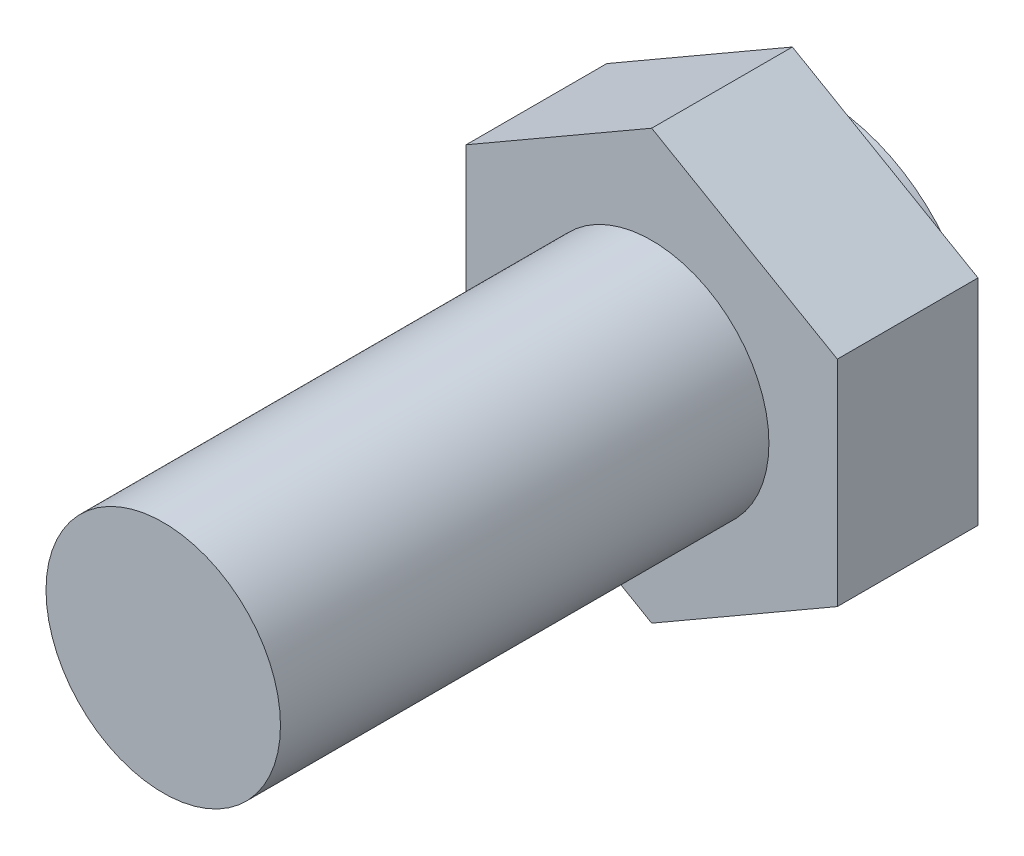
ISO-10303-21;
HEADER;
FILE_DESCRIPTION(('STEP AP214'),'2;1');
FILE_NAME('part.step','',(''),(''),'','','');
FILE_SCHEMA(('AUTOMOTIVE_DESIGN { 1 0 10303 214 1 1 1 1 }'));
ENDSEC;
DATA;
#1=APPLICATION_CONTEXT('core data for automotive mechanical design processes');
#2=APPLICATION_PROTOCOL_DEFINITION('international standard','automotive_design',2000,#1);
#3=PRODUCT_CONTEXT('',#1,'mechanical');
#4=PRODUCT('Part','Part','',(#3));
#5=PRODUCT_RELATED_PRODUCT_CATEGORY('part','',(#4));
#6=PRODUCT_DEFINITION_FORMATION('','',#4);
#7=PRODUCT_DEFINITION_CONTEXT('part definition',#1,'design');
#8=PRODUCT_DEFINITION('design','',#6,#7);
#9=PRODUCT_DEFINITION_SHAPE('','',#8);
#10=(LENGTH_UNIT() NAMED_UNIT(*) SI_UNIT(.MILLI.,.METRE.));
#11=(NAMED_UNIT(*) PLANE_ANGLE_UNIT() SI_UNIT($,.RADIAN.));
#12=(NAMED_UNIT(*) SI_UNIT($,.STERADIAN.) SOLID_ANGLE_UNIT());
#13=UNCERTAINTY_MEASURE_WITH_UNIT(LENGTH_MEASURE(1.E-05),#10,'distance_accuracy_value','');
#14=(GEOMETRIC_REPRESENTATION_CONTEXT(3) GLOBAL_UNCERTAINTY_ASSIGNED_CONTEXT((#13)) GLOBAL_UNIT_ASSIGNED_CONTEXT((#10,
#11,#12)) REPRESENTATION_CONTEXT('',''));
#15=CARTESIAN_POINT('',(0.,0.,0.));
#16=DIRECTION('',(0.,0.,1.));
#17=DIRECTION('',(1.,0.,0.));
#18=AXIS2_PLACEMENT_3D('',#15,#16,#17);
#19=CARTESIAN_POINT('',(0.,0.,33.7));
#20=DIRECTION('',(0.,0.,-1.));
#21=DIRECTION('',(-1.,0.,0.));
#22=AXIS2_PLACEMENT_3D('',#19,#20,#21);
#23=PLANE('',#22);
#24=CARTESIAN_POINT('',(0.,0.,33.7));
#25=DIRECTION('',(0.,0.,-1.));
#26=DIRECTION('',(-1.,0.,0.));
#27=AXIS2_PLACEMENT_3D('',#24,#25,#26);
#28=CIRCLE('',#27,6.);
#29=CARTESIAN_POINT('',(-6.,0.,33.7));
#30=VERTEX_POINT('',#29);
#31=EDGE_CURVE('E22',#30,#30,#28,.T.);
#32=ORIENTED_EDGE('',*,*,#31,.F.);
#33=EDGE_LOOP('',(#32));
#34=FACE_BOUND('',#33,.T.);
#35=ADVANCED_FACE('F15',(#34),#23,.F.);
#36=CARTESIAN_POINT('',(0.,0.,-36.3));
#37=DIRECTION('',(0.,0.,-1.));
#38=DIRECTION('',(-1.,0.,0.));
#39=AXIS2_PLACEMENT_3D('',#36,#37,#38);
#40=CYLINDRICAL_SURFACE('',#39,6.);
#41=CARTESIAN_POINT('',(0.,0.,8.7));
#42=DIRECTION('',(0.,0.,-1.));
#43=DIRECTION('',(-1.,0.,0.));
#44=AXIS2_PLACEMENT_3D('',#41,#42,#43);
#45=CIRCLE('',#44,6.);
#46=CARTESIAN_POINT('',(-6.,0.,8.7));
#47=VERTEX_POINT('',#46);
#48=EDGE_CURVE('E110',#47,#47,#45,.T.);
#49=ORIENTED_EDGE('',*,*,#48,.F.);
#50=EDGE_LOOP('',(#49));
#51=FACE_BOUND('',#50,.T.);
#52=ORIENTED_EDGE('',*,*,#31,.T.);
#53=EDGE_LOOP('',(#52));
#54=FACE_BOUND('',#53,.T.);
#55=ADVANCED_FACE('F154',(#51,#54),#40,.T.);
#56=CARTESIAN_POINT('',(-6.,0.,8.7));
#57=DIRECTION('',(0.,0.,-1.));
#58=DIRECTION('',(-1.,0.,0.));
#59=AXIS2_PLACEMENT_3D('',#56,#57,#58);
#60=PLANE('',#59);
#61=DIRECTION('',(0.866025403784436,-0.5,0.));
#62=VECTOR('',#61,1.);
#63=CARTESIAN_POINT('',(0.250000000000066,10.8253175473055,8.7));
#64=LINE('',#63,#62);
#65=CARTESIAN_POINT('',(0.,10.9696551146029,8.7));
#66=VERTEX_POINT('',#65);
#67=CARTESIAN_POINT('',(9.5,5.48482755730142,8.7));
#68=VERTEX_POINT('',#67);
#69=EDGE_CURVE('E81',#66,#68,#64,.T.);
#70=ORIENTED_EDGE('',*,*,#69,.F.);
#71=DIRECTION('',(-0.866025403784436,-0.5,0.));
#72=VECTOR('',#71,1.);
#73=CARTESIAN_POINT('',(-9.25,5.62916512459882,8.7));
#74=LINE('',#73,#72);
#75=CARTESIAN_POINT('',(-9.5,5.48482755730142,8.7));
#76=VERTEX_POINT('',#75);
#77=EDGE_CURVE('E107',#66,#76,#74,.T.);
#78=ORIENTED_EDGE('',*,*,#77,.T.);
#79=DIRECTION('',(0.,-1.,0.));
#80=VECTOR('',#79,1.);
#81=CARTESIAN_POINT('',(-9.5,0.,8.7));
#82=LINE('',#81,#80);
#83=CARTESIAN_POINT('',(-9.5,-5.48482755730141,8.7));
#84=VERTEX_POINT('',#83);
#85=EDGE_CURVE('E104',#76,#84,#82,.T.);
#86=ORIENTED_EDGE('',*,*,#85,.T.);
#87=DIRECTION('',(-0.866025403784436,0.5,0.));
#88=VECTOR('',#87,1.);
#89=CARTESIAN_POINT('',(-9.25,-5.62916512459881,8.7));
#90=LINE('',#89,#88);
#91=CARTESIAN_POINT('',(0.,-10.9696551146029,8.7));
#92=VERTEX_POINT('',#91);
#93=EDGE_CURVE('E102',#92,#84,#90,.T.);
#94=ORIENTED_EDGE('',*,*,#93,.F.);
#95=DIRECTION('',(0.866025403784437,0.5,0.));
#96=VECTOR('',#95,1.);
#97=CARTESIAN_POINT('',(0.250000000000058,-10.8253175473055,8.7));
#98=LINE('',#97,#96);
#99=CARTESIAN_POINT('',(9.5,-5.48482755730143,8.7));
#100=VERTEX_POINT('',#99);
#101=EDGE_CURVE('E99',#92,#100,#98,.T.);
#102=ORIENTED_EDGE('',*,*,#101,.T.);
#103=DIRECTION('',(0.,-1.,0.));
#104=VECTOR('',#103,1.);
#105=CARTESIAN_POINT('',(9.5,0.,8.7));
#106=LINE('',#105,#104);
#107=EDGE_CURVE('E97',#68,#100,#106,.T.);
#108=ORIENTED_EDGE('',*,*,#107,.F.);
#109=EDGE_LOOP('',(#70,#78,#86,#94,#102,#108));
#110=FACE_BOUND('',#109,.T.);
#111=ORIENTED_EDGE('',*,*,#48,.T.);
#112=EDGE_LOOP('',(#111));
#113=FACE_BOUND('',#112,.T.);
#114=ADVANCED_FACE('F136',(#110,#113),#60,.F.);
#115=CARTESIAN_POINT('',(0.,10.9696551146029,10.));
#116=DIRECTION('',(0.5,-0.866025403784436,0.));
#117=DIRECTION('',(-0.866025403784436,-0.5,0.));
#118=AXIS2_PLACEMENT_3D('',#115,#116,#117);
#119=PLANE('',#118);
#120=DIRECTION('',(0.,0.,-1.));
#121=VECTOR('',#120,1.);
#122=CARTESIAN_POINT('',(0.,10.9696551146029,10.));
#123=LINE('',#122,#121);
#124=CARTESIAN_POINT('',(0.,10.9696551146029,1.5));
#125=VERTEX_POINT('',#124);
#126=EDGE_CURVE('E35',#66,#125,#123,.T.);
#127=ORIENTED_EDGE('',*,*,#126,.T.);
#128=DIRECTION('',(-0.866025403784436,-0.5,0.));
#129=VECTOR('',#128,1.);
#130=CARTESIAN_POINT('',(0.,10.9696551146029,1.5));
#131=LINE('',#130,#129);
#132=CARTESIAN_POINT('',(-9.5,5.48482755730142,1.5));
#133=VERTEX_POINT('',#132);
#134=EDGE_CURVE('E28',#125,#133,#131,.T.);
#135=ORIENTED_EDGE('',*,*,#134,.T.);
#136=DIRECTION('',(0.,0.,-1.));
#137=VECTOR('',#136,1.);
#138=CARTESIAN_POINT('',(-9.5,5.48482755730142,10.));
#139=LINE('',#138,#137);
#140=EDGE_CURVE('E93',#76,#133,#139,.T.);
#141=ORIENTED_EDGE('',*,*,#140,.F.);
#142=ORIENTED_EDGE('',*,*,#77,.F.);
#143=EDGE_LOOP('',(#127,#135,#141,#142));
#144=FACE_BOUND('',#143,.T.);
#145=ADVANCED_FACE('F130',(#144),#119,.F.);
#146=CARTESIAN_POINT('',(-9.5,5.48482755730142,10.));
#147=DIRECTION('',(1.,0.,0.));
#148=DIRECTION('',(0.,0.,-1.));
#149=AXIS2_PLACEMENT_3D('',#146,#147,#148);
#150=PLANE('',#149);
#151=ORIENTED_EDGE('',*,*,#140,.T.);
#152=DIRECTION('',(0.,-1.,0.));
#153=VECTOR('',#152,1.);
#154=CARTESIAN_POINT('',(-9.5,5.48482755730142,1.5));
#155=LINE('',#154,#153);
#156=CARTESIAN_POINT('',(-9.5,-5.48482755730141,1.5));
#157=VERTEX_POINT('',#156);
#158=EDGE_CURVE('E126',#133,#157,#155,.T.);
#159=ORIENTED_EDGE('',*,*,#158,.T.);
#160=DIRECTION('',(0.,0.,-1.));
#161=VECTOR('',#160,1.);
#162=CARTESIAN_POINT('',(-9.5,-5.48482755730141,10.));
#163=LINE('',#162,#161);
#164=EDGE_CURVE('E90',#84,#157,#163,.T.);
#165=ORIENTED_EDGE('',*,*,#164,.F.);
#166=ORIENTED_EDGE('',*,*,#85,.F.);
#167=EDGE_LOOP('',(#151,#159,#165,#166));
#168=FACE_BOUND('',#167,.T.);
#169=ADVANCED_FACE('F132',(#168),#150,.F.);
#170=CARTESIAN_POINT('',(0.,-10.9696551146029,10.));
#171=DIRECTION('',(-0.5,-0.866025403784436,0.));
#172=DIRECTION('',(-0.866025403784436,0.5,0.));
#173=AXIS2_PLACEMENT_3D('',#170,#171,#172);
#174=PLANE('',#173);
#175=DIRECTION('',(-0.866025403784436,0.5,0.));
#176=VECTOR('',#175,1.);
#177=CARTESIAN_POINT('',(0.,-10.9696551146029,1.5));
#178=LINE('',#177,#176);
#179=CARTESIAN_POINT('',(0.,-10.9696551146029,1.5));
#180=VERTEX_POINT('',#179);
#181=EDGE_CURVE('E124',#180,#157,#178,.T.);
#182=ORIENTED_EDGE('',*,*,#181,.F.);
#183=DIRECTION('',(0.,0.,-1.));
#184=VECTOR('',#183,1.);
#185=CARTESIAN_POINT('',(0.,-10.9696551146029,10.));
#186=LINE('',#185,#184);
#187=EDGE_CURVE('E83',#92,#180,#186,.T.);
#188=ORIENTED_EDGE('',*,*,#187,.F.);
#189=ORIENTED_EDGE('',*,*,#93,.T.);
#190=ORIENTED_EDGE('',*,*,#164,.T.);
#191=EDGE_LOOP('',(#182,#188,#189,#190));
#192=FACE_BOUND('',#191,.T.);
#193=ADVANCED_FACE('F143',(#192),#174,.T.);
#194=CARTESIAN_POINT('',(0.,-10.9696551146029,10.));
#195=DIRECTION('',(-0.5,0.866025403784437,0.));
#196=DIRECTION('',(0.866025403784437,0.5,0.));
#197=AXIS2_PLACEMENT_3D('',#194,#195,#196);
#198=PLANE('',#197);
#199=ORIENTED_EDGE('',*,*,#187,.T.);
#200=DIRECTION('',(0.866025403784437,0.5,0.));
#201=VECTOR('',#200,1.);
#202=CARTESIAN_POINT('',(0.,-10.9696551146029,1.5));
#203=LINE('',#202,#201);
#204=CARTESIAN_POINT('',(9.5,-5.48482755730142,1.5));
#205=VERTEX_POINT('',#204);
#206=EDGE_CURVE('E76',#180,#205,#203,.T.);
#207=ORIENTED_EDGE('',*,*,#206,.T.);
#208=DIRECTION('',(0.,0.,-1.));
#209=VECTOR('',#208,1.);
#210=CARTESIAN_POINT('',(9.5,-5.48482755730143,10.));
#211=LINE('',#210,#209);
#212=EDGE_CURVE('E75',#100,#205,#211,.T.);
#213=ORIENTED_EDGE('',*,*,#212,.F.);
#214=ORIENTED_EDGE('',*,*,#101,.F.);
#215=EDGE_LOOP('',(#199,#207,#213,#214));
#216=FACE_BOUND('',#215,.T.);
#217=ADVANCED_FACE('F139',(#216),#198,.F.);
#218=CARTESIAN_POINT('',(9.5,5.48482755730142,10.));
#219=DIRECTION('',(1.,0.,0.));
#220=DIRECTION('',(0.,-1.,0.));
#221=AXIS2_PLACEMENT_3D('',#218,#219,#220);
#222=PLANE('',#221);
#223=DIRECTION('',(0.,-1.,0.));
#224=VECTOR('',#223,1.);
#225=CARTESIAN_POINT('',(9.5,5.48482755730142,1.5));
#226=LINE('',#225,#224);
#227=CARTESIAN_POINT('',(9.5,5.48482755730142,1.5));
#228=VERTEX_POINT('',#227);
#229=EDGE_CURVE('E65',#228,#205,#226,.T.);
#230=ORIENTED_EDGE('',*,*,#229,.F.);
#231=DIRECTION('',(0.,0.,-1.));
#232=VECTOR('',#231,1.);
#233=CARTESIAN_POINT('',(9.5,5.48482755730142,10.));
#234=LINE('',#233,#232);
#235=EDGE_CURVE('E72',#68,#228,#234,.T.);
#236=ORIENTED_EDGE('',*,*,#235,.F.);
#237=ORIENTED_EDGE('',*,*,#107,.T.);
#238=ORIENTED_EDGE('',*,*,#212,.T.);
#239=EDGE_LOOP('',(#230,#236,#237,#238));
#240=FACE_BOUND('',#239,.T.);
#241=ADVANCED_FACE('F71',(#240),#222,.T.);
#242=CARTESIAN_POINT('',(0.,10.9696551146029,10.));
#243=DIRECTION('',(0.5,0.866025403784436,0.));
#244=DIRECTION('',(0.866025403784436,-0.5,0.));
#245=AXIS2_PLACEMENT_3D('',#242,#243,#244);
#246=PLANE('',#245);
#247=DIRECTION('',(0.866025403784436,-0.5,0.));
#248=VECTOR('',#247,1.);
#249=CARTESIAN_POINT('',(0.,10.9696551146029,1.5));
#250=LINE('',#249,#248);
#251=EDGE_CURVE('E9',#125,#228,#250,.T.);
#252=ORIENTED_EDGE('',*,*,#251,.F.);
#253=ORIENTED_EDGE('',*,*,#126,.F.);
#254=ORIENTED_EDGE('',*,*,#69,.T.);
#255=ORIENTED_EDGE('',*,*,#235,.T.);
#256=EDGE_LOOP('',(#252,#253,#254,#255));
#257=FACE_BOUND('',#256,.T.);
#258=ADVANCED_FACE('F79',(#257),#246,.T.);
#259=CARTESIAN_POINT('',(0.,14.4999999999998,1.5));
#260=DIRECTION('',(0.,0.,1.));
#261=DIRECTION('',(1.,0.,0.));
#262=AXIS2_PLACEMENT_3D('',#259,#260,#261);
#263=PLANE('',#262);
#264=CARTESIAN_POINT('',(0.,0.,1.5));
#265=DIRECTION('',(0.,0.,-1.));
#266=DIRECTION('',(-1.,0.,0.));
#267=AXIS2_PLACEMENT_3D('',#264,#265,#266);
#268=CIRCLE('',#267,7.95);
#269=CARTESIAN_POINT('',(-7.95,0.,1.5));
#270=VERTEX_POINT('',#269);
#271=EDGE_CURVE('E115',#270,#270,#268,.T.);
#272=ORIENTED_EDGE('',*,*,#271,.F.);
#273=EDGE_LOOP('',(#272));
#274=FACE_BOUND('',#273,.T.);
#275=ORIENTED_EDGE('',*,*,#251,.T.);
#276=ORIENTED_EDGE('',*,*,#229,.T.);
#277=ORIENTED_EDGE('',*,*,#206,.F.);
#278=ORIENTED_EDGE('',*,*,#181,.T.);
#279=ORIENTED_EDGE('',*,*,#158,.F.);
#280=ORIENTED_EDGE('',*,*,#134,.F.);
#281=EDGE_LOOP('',(#275,#276,#277,#278,#279,#280));
#282=FACE_BOUND('',#281,.T.);
#283=ADVANCED_FACE('F64',(#274,#282),#263,.F.);
#284=CARTESIAN_POINT('',(0.,0.,-6.3));
#285=DIRECTION('',(0.,0.,-1.));
#286=DIRECTION('',(-1.,0.,0.));
#287=AXIS2_PLACEMENT_3D('',#284,#285,#286);
#288=CYLINDRICAL_SURFACE('',#287,7.95);
#289=ORIENTED_EDGE('',*,*,#271,.T.);
#290=EDGE_LOOP('',(#289));
#291=FACE_BOUND('',#290,.T.);
#292=CARTESIAN_POINT('',(0.,0.,0.));
#293=DIRECTION('',(0.,0.,1.));
#294=DIRECTION('',(1.,0.,0.));
#295=AXIS2_PLACEMENT_3D('',#292,#293,#294);
#296=CIRCLE('',#295,7.95);
#297=CARTESIAN_POINT('',(7.95,0.,0.));
#298=VERTEX_POINT('',#297);
#299=EDGE_CURVE('E77',#298,#298,#296,.T.);
#300=ORIENTED_EDGE('',*,*,#299,.T.);
#301=EDGE_LOOP('',(#300));
#302=FACE_BOUND('',#301,.T.);
#303=ADVANCED_FACE('F170',(#291,#302),#288,.T.);
#304=CARTESIAN_POINT('',(-11.,0.,0.));
#305=DIRECTION('',(0.,0.,1.));
#306=DIRECTION('',(1.,0.,0.));
#307=AXIS2_PLACEMENT_3D('',#304,#305,#306);
#308=PLANE('',#307);
#309=ORIENTED_EDGE('',*,*,#299,.F.);
#310=EDGE_LOOP('',(#309));
#311=FACE_BOUND('',#310,.T.);
#312=ADVANCED_FACE('F168',(#311),#308,.F.);
#313=CLOSED_SHELL('',(#35,#55,#114,#145,#169,#193,#217,#241,#258,#283,#303,#312));
#314=MANIFOLD_SOLID_BREP('B1',#313);
#315=ADVANCED_BREP_SHAPE_REPRESENTATION('',(#18,#314),#14);
#316=SHAPE_DEFINITION_REPRESENTATION(#9,#315);
ENDSEC;
END-ISO-10303-21;
